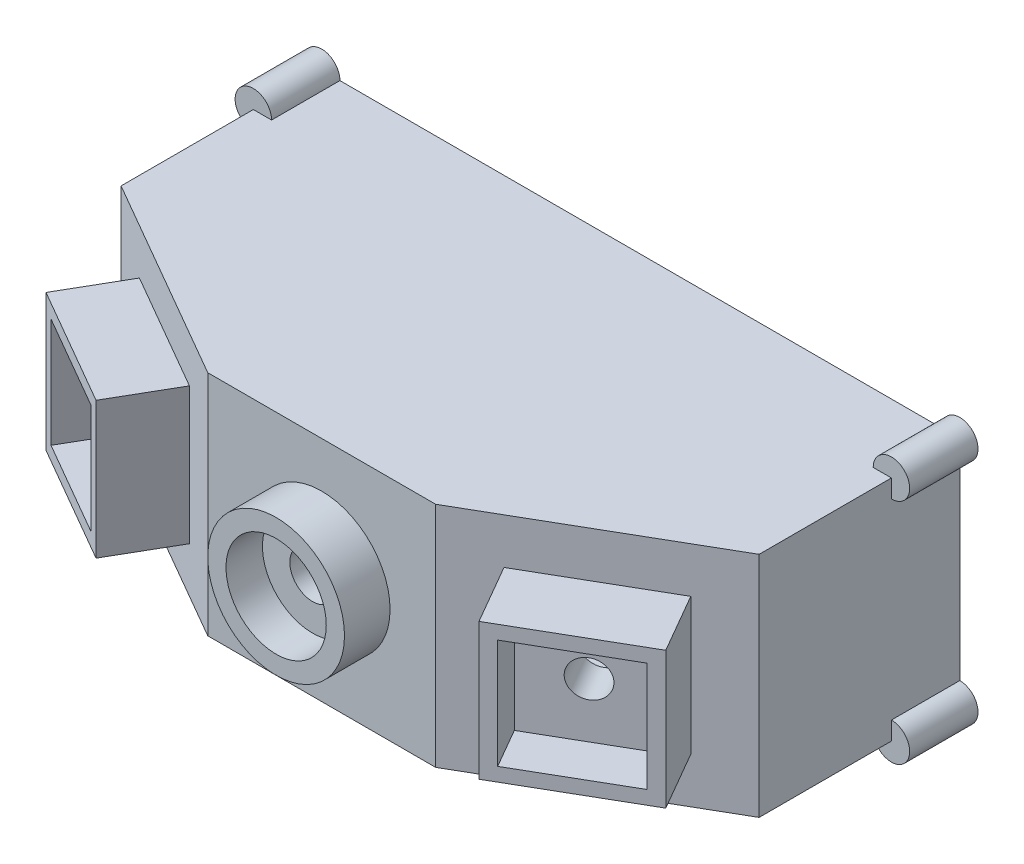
from build123d import *

# Parameters (mm, degrees)
CROQUIS2_W              = 140
CROQUIS2_H              = 70
SALIENTE_EXTRUIR1_DEPTH = 50
CORTAR_EXTRUIR1_DEPTH   = 50
VACIADO1_T              = -4
CROQUIS5_R              = 15
SALIENTE_EXTRUIR2_DEPTH = 10
CROQUIS6_R              = 11
CORTAR_EXTRUIR2_DEPTH   = 8
CROQUIS7_R              = 5
CORTAR_EXTRUIR3_DEPTH   = 113.178429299
CROQUIS8_W              = 30
CROQUIS8_H              = 30
SALIENTE_EXTRUIR3_DEPTH = 15
CROQUIS9_W              = 24
CROQUIS9_H              = 24
CORTAR_EXTRUIR4_DEPTH   = 10
CROQUIS10_R             = 4
CORTAR_EXTRUIR5_DEPTH   = 10
CORTAR_EXTRUIR6_DEPTH   = 10
CROQUIS12_R             = 4
SALIENTE_EXTRUIR4_DEPTH = 15
CROQUIS15_R             = 1.25
CORTAR_EXTRUIR7_DEPTH   = 10


with BuildPart() as part:
    # Croquis2 → Saliente-Extruir1 (new body)
    with BuildSketch(Plane(origin=(0, 0, 0), x_dir=(1, 0, 0), z_dir=(0, 1, 0))):
        Rectangle(CROQUIS2_W, CROQUIS2_H)
    extrude(amount=SALIENTE_EXTRUIR1_DEPTH)

    # Croquis4 → Cortar-Extruir1 (cut)
    with BuildSketch(Plane(origin=(0, 50, 0), x_dir=(1, 0, 0), z_dir=(0, 1, 0))):
        Polygon((-70, -9.019237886), (-25, -35), (-70, -35), align=None)
        Polygon((70, -9.019237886), (25, -35), (70, -35), align=None)
    extrude(amount=-CORTAR_EXTRUIR1_DEPTH, mode=Mode.SUBTRACT)

    # Vaciado1
    vaciado1_openings = [part.faces().sort_by_distance(p)[0] for p in [
        (0, 25, -35),
    ]]
    offset(amount=VACIADO1_T, openings=vaciado1_openings, kind=Kind.INTERSECTION)

    # Croquis5 → Saliente-Extruir2 (add)
    with BuildSketch(Plane.XY.offset(35)):
        with Locations((0, 25)):
            Circle(CROQUIS5_R)
    extrude(amount=SALIENTE_EXTRUIR2_DEPTH)

    # Croquis6 → Cortar-Extruir2 (cut)
    with BuildSketch(Plane.XY.offset(45)):
        with Locations((0, 25)):
            Circle(CROQUIS6_R)
    extrude(amount=-CORTAR_EXTRUIR2_DEPTH, mode=Mode.SUBTRACT)

    # Croquis7 → Cortar-Extruir3 (cut, through all)
    with BuildSketch(Plane.XY.offset(37)):
        with Locations((0, 25)):
            Circle(CROQUIS7_R)
    extrude(amount=-CORTAR_EXTRUIR3_DEPTH, mode=Mode.SUBTRACT)

    # Croquis8 → Saliente-Extruir3 (add)
    with BuildSketch(Plane(origin=(-21.405444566, 0, 37.075317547), x_dir=(0.8660254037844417, 0, 0.49999999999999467), z_dir=(-0.49999999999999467, 0, 0.8660254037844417))):
        with Locations((-30.131397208, 25)):
            Rectangle(CROQUIS8_W, CROQUIS8_H)
    saliente_extruir3 = extrude(amount=SALIENTE_EXTRUIR3_DEPTH)

    # Croquis9 → Cortar-Extruir4 (cut)
    with BuildSketch(Plane(origin=(-28.905444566, 0, 50.065698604), x_dir=(0.8660254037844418, 0, 0.4999999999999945), z_dir=(-0.49999999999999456, 0, 0.8660254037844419))):
        with Locations((-30.131397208, 25)):
            Rectangle(CROQUIS9_W, CROQUIS9_H)
    cortar_extruir4 = extrude(amount=-CORTAR_EXTRUIR4_DEPTH, mode=Mode.SUBTRACT)

    # Croquis10 → Cortar-Extruir5 (cut)
    with BuildSketch(Plane(origin=(-23.905444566, 0, 41.405444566), x_dir=(0.8660254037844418, 0, 0.4999999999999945), z_dir=(-0.4999999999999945, 0, 0.8660254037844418))):
        with Locations((-30.131397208, 25)):
            Circle(CROQUIS10_R)
    cortar_extruir5 = extrude(amount=-CORTAR_EXTRUIR5_DEPTH, mode=Mode.SUBTRACT)

    # Simetr_a1: Saliente-Extruir3, Cortar-Extruir4, Cortar-Extruir5 across plane
    add(saliente_extruir3.mirror(Plane(origin=(0, 0, 0), x_dir=(0, 0, 1), z_dir=(1, 0, 0))))
    add(cortar_extruir4.mirror(Plane(origin=(0, 0, 0), x_dir=(0, 0, 1), z_dir=(1, 0, 0))), mode=Mode.SUBTRACT)
    add(cortar_extruir5.mirror(Plane(origin=(0, 0, 0), x_dir=(0, 0, 1), z_dir=(1, 0, 0))), mode=Mode.SUBTRACT)

    # Croquis11 → Cortar-Extruir6 (cut)
    with BuildSketch(Plane.XZ):
        with BuildLine():
            Line((-7.5, 9.509618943), (7.5, 9.509618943))
            ThreePointArc((7.5, 9.509618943), (10, 7.009618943), (7.5, 4.509618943))
            Line((7.5, 4.509618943), (-7.5, 4.509618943))
            ThreePointArc((-7.5, 4.509618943), (-10, 7.009618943), (-7.5, 9.509618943))
        make_face()
        with BuildLine():
            Line((-7.5, -0.490381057), (7.5, -0.490381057))
            ThreePointArc((7.5, -0.490381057), (10, -2.990381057), (7.5, -5.490381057))
            Line((7.5, -5.490381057), (-7.5, -5.490381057))
            ThreePointArc((-7.5, -5.490381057), (-10, -2.990381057), (-7.5, -0.490381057))
        make_face()
        with BuildLine():
            Line((-7.5, -10.490381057), (7.5, -10.490381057))
            ThreePointArc((7.5, -10.490381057), (10, -12.990381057), (7.5, -15.490381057))
            Line((7.5, -15.490381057), (-7.5, -15.490381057))
            ThreePointArc((-7.5, -15.490381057), (-10, -12.990381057), (-7.5, -10.490381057))
        make_face()
    extrude(amount=-CORTAR_EXTRUIR6_DEPTH, mode=Mode.SUBTRACT)

    # Croquis12 → Saliente-Extruir4 (add)
    with BuildSketch(Plane(origin=(0, 0, -35), x_dir=(-1, 0, 0), z_dir=(0, 0, -1))):
        with Locations((70, 50)):
            Circle(CROQUIS12_R)
        with Locations((-70, 50)):
            Circle(CROQUIS12_R)
        with Locations((-70, 0)):
            Circle(CROQUIS12_R)
        with Locations((70, 0)):
            Circle(CROQUIS12_R)
    extrude(amount=-SALIENTE_EXTRUIR4_DEPTH)

    # Croquis15 → Cortar-Extruir7 (cut)
    with BuildSketch(Plane(origin=(0, 0, -35), x_dir=(-1, 0, 0), z_dir=(0, 0, -1))):
        with Locations((70, 50)):
            Circle(CROQUIS15_R)
        with Locations((70, 0)):
            Circle(CROQUIS15_R)
        with Locations((-70, 0)):
            Circle(CROQUIS15_R)
        with Locations((-70, 50)):
            Circle(CROQUIS15_R)
    extrude(amount=-CORTAR_EXTRUIR7_DEPTH, mode=Mode.SUBTRACT)


solid = part.part
